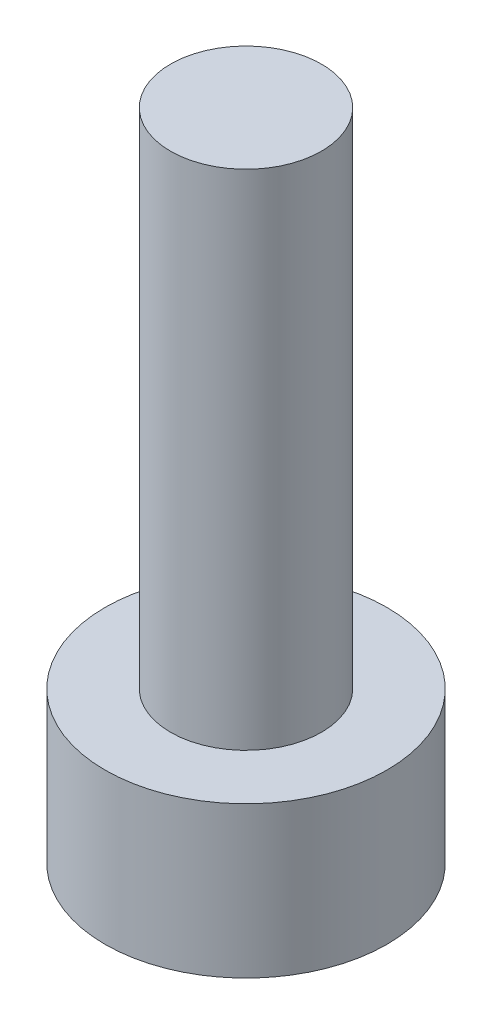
ISO-10303-21;
HEADER;
FILE_DESCRIPTION(('STEP AP214'),'2;1');
FILE_NAME('part.step','',(''),(''),'','','');
FILE_SCHEMA(('AUTOMOTIVE_DESIGN { 1 0 10303 214 1 1 1 1 }'));
ENDSEC;
DATA;
#1=APPLICATION_CONTEXT('core data for automotive mechanical design processes');
#2=APPLICATION_PROTOCOL_DEFINITION('international standard','automotive_design',2000,#1);
#3=PRODUCT_CONTEXT('',#1,'mechanical');
#4=PRODUCT('Part','Part','',(#3));
#5=PRODUCT_RELATED_PRODUCT_CATEGORY('part','',(#4));
#6=PRODUCT_DEFINITION_FORMATION('','',#4);
#7=PRODUCT_DEFINITION_CONTEXT('part definition',#1,'design');
#8=PRODUCT_DEFINITION('design','',#6,#7);
#9=PRODUCT_DEFINITION_SHAPE('','',#8);
#10=(LENGTH_UNIT() NAMED_UNIT(*) SI_UNIT(.MILLI.,.METRE.));
#11=(NAMED_UNIT(*) PLANE_ANGLE_UNIT() SI_UNIT($,.RADIAN.));
#12=(NAMED_UNIT(*) SI_UNIT($,.STERADIAN.) SOLID_ANGLE_UNIT());
#13=UNCERTAINTY_MEASURE_WITH_UNIT(LENGTH_MEASURE(1.E-05),#10,'distance_accuracy_value','');
#14=(GEOMETRIC_REPRESENTATION_CONTEXT(3) GLOBAL_UNCERTAINTY_ASSIGNED_CONTEXT((#13)) GLOBAL_UNIT_ASSIGNED_CONTEXT((#10,
#11,#12)) REPRESENTATION_CONTEXT('',''));
#15=CARTESIAN_POINT('',(0.,0.,0.));
#16=DIRECTION('',(0.,0.,1.));
#17=DIRECTION('',(1.,0.,0.));
#18=AXIS2_PLACEMENT_3D('',#15,#16,#17);
#19=CARTESIAN_POINT('',(0.,3.,0.));
#20=DIRECTION('',(0.,-1.,0.));
#21=DIRECTION('',(0.,0.,-1.));
#22=AXIS2_PLACEMENT_3D('',#19,#20,#21);
#23=CYLINDRICAL_SURFACE('',#22,2.8);
#24=CARTESIAN_POINT('',(0.,3.,0.));
#25=DIRECTION('',(0.,1.,0.));
#26=DIRECTION('',(0.,0.,1.));
#27=AXIS2_PLACEMENT_3D('',#24,#25,#26);
#28=CIRCLE('',#27,2.8);
#29=CARTESIAN_POINT('',(0.,3.,2.8));
#30=VERTEX_POINT('',#29);
#31=EDGE_CURVE('E51',#30,#30,#28,.T.);
#32=ORIENTED_EDGE('',*,*,#31,.F.);
#33=EDGE_LOOP('',(#32));
#34=FACE_BOUND('',#33,.T.);
#35=CARTESIAN_POINT('',(0.,0.,0.));
#36=DIRECTION('',(0.,1.,0.));
#37=DIRECTION('',(0.,0.,1.));
#38=AXIS2_PLACEMENT_3D('',#35,#36,#37);
#39=CIRCLE('',#38,2.8);
#40=CARTESIAN_POINT('',(0.,0.,2.8));
#41=VERTEX_POINT('',#40);
#42=EDGE_CURVE('E46',#41,#41,#39,.T.);
#43=ORIENTED_EDGE('',*,*,#42,.T.);
#44=EDGE_LOOP('',(#43));
#45=FACE_BOUND('',#44,.T.);
#46=ADVANCED_FACE('F43',(#34,#45),#23,.T.);
#47=CARTESIAN_POINT('',(0.,3.,0.));
#48=DIRECTION('',(0.,1.,0.));
#49=DIRECTION('',(0.,0.,1.));
#50=AXIS2_PLACEMENT_3D('',#47,#48,#49);
#51=PLANE('',#50);
#52=CARTESIAN_POINT('',(0.,3.,0.));
#53=DIRECTION('',(0.,1.,0.));
#54=DIRECTION('',(0.,0.,1.));
#55=AXIS2_PLACEMENT_3D('',#52,#53,#54);
#56=CIRCLE('',#55,1.5);
#57=CARTESIAN_POINT('',(0.,3.,1.5));
#58=VERTEX_POINT('',#57);
#59=EDGE_CURVE('E11',#58,#58,#56,.T.);
#60=ORIENTED_EDGE('',*,*,#59,.F.);
#61=EDGE_LOOP('',(#60));
#62=FACE_BOUND('',#61,.T.);
#63=ORIENTED_EDGE('',*,*,#31,.T.);
#64=EDGE_LOOP('',(#63));
#65=FACE_BOUND('',#64,.T.);
#66=ADVANCED_FACE('F161',(#62,#65),#51,.T.);
#67=CARTESIAN_POINT('',(0.,0.,0.));
#68=DIRECTION('',(0.,1.,0.));
#69=DIRECTION('',(0.,0.,1.));
#70=AXIS2_PLACEMENT_3D('',#67,#68,#69);
#71=PLANE('',#70);
#72=DIRECTION('',(0.195712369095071,0.,0.980661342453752));
#73=VECTOR('',#72,1.);
#74=CARTESIAN_POINT('',(1.08458344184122,0.,-0.952371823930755));
#75=LINE('',#74,#73);
#76=CARTESIAN_POINT('',(1.08458344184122,0.,-0.952371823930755));
#77=VERTEX_POINT('',#76);
#78=CARTESIAN_POINT('',(1.36706991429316,0.,0.463090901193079));
#79=VERTEX_POINT('',#78);
#80=EDGE_CURVE('E135',#77,#79,#75,.T.);
#81=ORIENTED_EDGE('',*,*,#80,.F.);
#82=DIRECTION('',(0.947133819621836,0.,0.320838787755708));
#83=VECTOR('',#82,1.);
#84=CARTESIAN_POINT('',(-0.282486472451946,0.,-1.41546272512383));
#85=LINE('',#84,#83);
#86=CARTESIAN_POINT('',(-0.282486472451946,0.,-1.41546272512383));
#87=VERTEX_POINT('',#86);
#88=EDGE_CURVE('E56',#87,#77,#85,.T.);
#89=ORIENTED_EDGE('',*,*,#88,.F.);
#90=DIRECTION('',(0.751421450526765,0.,-0.659822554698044));
#91=VECTOR('',#90,1.);
#92=CARTESIAN_POINT('',(-1.36706991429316,0.,-0.463090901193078));
#93=LINE('',#92,#91);
#94=CARTESIAN_POINT('',(-1.36706991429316,0.,-0.463090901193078));
#95=VERTEX_POINT('',#94);
#96=EDGE_CURVE('E145',#95,#87,#93,.T.);
#97=ORIENTED_EDGE('',*,*,#96,.F.);
#98=DIRECTION('',(-0.195712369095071,0.,-0.980661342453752));
#99=VECTOR('',#98,1.);
#100=CARTESIAN_POINT('',(-1.08458344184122,0.,0.952371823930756));
#101=LINE('',#100,#99);
#102=CARTESIAN_POINT('',(-1.08458344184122,0.,0.952371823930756));
#103=VERTEX_POINT('',#102);
#104=EDGE_CURVE('E140',#103,#95,#101,.T.);
#105=ORIENTED_EDGE('',*,*,#104,.F.);
#106=DIRECTION('',(-0.947133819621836,0.,-0.320838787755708));
#107=VECTOR('',#106,1.);
#108=CARTESIAN_POINT('',(0.282486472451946,0.,1.41546272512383));
#109=LINE('',#108,#107);
#110=CARTESIAN_POINT('',(0.282486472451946,0.,1.41546272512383));
#111=VERTEX_POINT('',#110);
#112=EDGE_CURVE('E110',#111,#103,#109,.T.);
#113=ORIENTED_EDGE('',*,*,#112,.F.);
#114=DIRECTION('',(-0.751421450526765,0.,0.659822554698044));
#115=VECTOR('',#114,1.);
#116=CARTESIAN_POINT('',(1.36706991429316,0.,0.463090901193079));
#117=LINE('',#116,#115);
#118=EDGE_CURVE('E136',#79,#111,#117,.T.);
#119=ORIENTED_EDGE('',*,*,#118,.F.);
#120=EDGE_LOOP('',(#81,#89,#97,#105,#113,#119));
#121=FACE_BOUND('',#120,.T.);
#122=ORIENTED_EDGE('',*,*,#42,.F.);
#123=EDGE_LOOP('',(#122));
#124=FACE_BOUND('',#123,.T.);
#125=ADVANCED_FACE('F160',(#121,#124),#71,.F.);
#126=CARTESIAN_POINT('',(0.,13.,0.));
#127=DIRECTION('',(0.,-1.,0.));
#128=DIRECTION('',(0.,0.,-1.));
#129=AXIS2_PLACEMENT_3D('',#126,#127,#128);
#130=CYLINDRICAL_SURFACE('',#129,1.5);
#131=CARTESIAN_POINT('',(0.,13.,0.));
#132=DIRECTION('',(0.,1.,0.));
#133=DIRECTION('',(0.,0.,1.));
#134=AXIS2_PLACEMENT_3D('',#131,#132,#133);
#135=CIRCLE('',#134,1.5);
#136=CARTESIAN_POINT('',(0.,13.,1.5));
#137=VERTEX_POINT('',#136);
#138=EDGE_CURVE('E147',#137,#137,#135,.T.);
#139=ORIENTED_EDGE('',*,*,#138,.F.);
#140=EDGE_LOOP('',(#139));
#141=FACE_BOUND('',#140,.T.);
#142=ORIENTED_EDGE('',*,*,#59,.T.);
#143=EDGE_LOOP('',(#142));
#144=FACE_BOUND('',#143,.T.);
#145=ADVANCED_FACE('F162',(#141,#144),#130,.T.);
#146=CARTESIAN_POINT('',(0.,13.,0.));
#147=DIRECTION('',(0.,1.,0.));
#148=DIRECTION('',(0.,0.,1.));
#149=AXIS2_PLACEMENT_3D('',#146,#147,#148);
#150=PLANE('',#149);
#151=ORIENTED_EDGE('',*,*,#138,.T.);
#152=EDGE_LOOP('',(#151));
#153=FACE_BOUND('',#152,.T.);
#154=ADVANCED_FACE('F167',(#153),#150,.T.);
#155=CARTESIAN_POINT('',(-0.282486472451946,1.5,-1.41546272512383));
#156=DIRECTION('',(0.320838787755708,0.,-0.947133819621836));
#157=DIRECTION('',(-0.947133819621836,0.,-0.320838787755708));
#158=AXIS2_PLACEMENT_3D('',#155,#156,#157);
#159=PLANE('',#158);
#160=ORIENTED_EDGE('',*,*,#88,.T.);
#161=DIRECTION('',(0.,-1.,0.));
#162=VECTOR('',#161,1.);
#163=CARTESIAN_POINT('',(1.08458344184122,1.5,-0.952371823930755));
#164=LINE('',#163,#162);
#165=CARTESIAN_POINT('',(1.08458344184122,1.5,-0.952371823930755));
#166=VERTEX_POINT('',#165);
#167=EDGE_CURVE('E88',#166,#77,#164,.T.);
#168=ORIENTED_EDGE('',*,*,#167,.F.);
#169=DIRECTION('',(0.947133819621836,0.,0.320838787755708));
#170=VECTOR('',#169,1.);
#171=CARTESIAN_POINT('',(-0.282486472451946,1.5,-1.41546272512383));
#172=LINE('',#171,#170);
#173=CARTESIAN_POINT('',(-0.282486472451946,1.5,-1.41546272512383));
#174=VERTEX_POINT('',#173);
#175=EDGE_CURVE('E144',#174,#166,#172,.T.);
#176=ORIENTED_EDGE('',*,*,#175,.F.);
#177=DIRECTION('',(0.,-1.,0.));
#178=VECTOR('',#177,1.);
#179=CARTESIAN_POINT('',(-0.282486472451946,1.5,-1.41546272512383));
#180=LINE('',#179,#178);
#181=EDGE_CURVE('E66',#174,#87,#180,.T.);
#182=ORIENTED_EDGE('',*,*,#181,.T.);
#183=EDGE_LOOP('',(#160,#168,#176,#182));
#184=FACE_BOUND('',#183,.T.);
#185=ADVANCED_FACE('F200',(#184),#159,.F.);
#186=CARTESIAN_POINT('',(-1.36706991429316,1.5,-0.463090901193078));
#187=DIRECTION('',(-0.659822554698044,0.,-0.751421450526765));
#188=DIRECTION('',(-0.751421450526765,0.,0.659822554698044));
#189=AXIS2_PLACEMENT_3D('',#186,#187,#188);
#190=PLANE('',#189);
#191=ORIENTED_EDGE('',*,*,#96,.T.);
#192=ORIENTED_EDGE('',*,*,#181,.F.);
#193=DIRECTION('',(0.751421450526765,0.,-0.659822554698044));
#194=VECTOR('',#193,1.);
#195=CARTESIAN_POINT('',(-1.36706991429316,1.5,-0.463090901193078));
#196=LINE('',#195,#194);
#197=CARTESIAN_POINT('',(-1.36706991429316,1.5,-0.463090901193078));
#198=VERTEX_POINT('',#197);
#199=EDGE_CURVE('E118',#198,#174,#196,.T.);
#200=ORIENTED_EDGE('',*,*,#199,.F.);
#201=DIRECTION('',(0.,-1.,0.));
#202=VECTOR('',#201,1.);
#203=CARTESIAN_POINT('',(-1.36706991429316,1.5,-0.463090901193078));
#204=LINE('',#203,#202);
#205=EDGE_CURVE('E111',#198,#95,#204,.T.);
#206=ORIENTED_EDGE('',*,*,#205,.T.);
#207=EDGE_LOOP('',(#191,#192,#200,#206));
#208=FACE_BOUND('',#207,.T.);
#209=ADVANCED_FACE('F208',(#208),#190,.F.);
#210=CARTESIAN_POINT('',(-1.08458344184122,1.5,0.952371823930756));
#211=DIRECTION('',(-0.980661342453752,0.,0.195712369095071));
#212=DIRECTION('',(0.195712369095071,0.,0.980661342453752));
#213=AXIS2_PLACEMENT_3D('',#210,#211,#212);
#214=PLANE('',#213);
#215=ORIENTED_EDGE('',*,*,#104,.T.);
#216=ORIENTED_EDGE('',*,*,#205,.F.);
#217=DIRECTION('',(-0.195712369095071,0.,-0.980661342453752));
#218=VECTOR('',#217,1.);
#219=CARTESIAN_POINT('',(-1.08458344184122,1.5,0.952371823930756));
#220=LINE('',#219,#218);
#221=CARTESIAN_POINT('',(-1.08458344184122,1.5,0.952371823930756));
#222=VERTEX_POINT('',#221);
#223=EDGE_CURVE('E114',#222,#198,#220,.T.);
#224=ORIENTED_EDGE('',*,*,#223,.F.);
#225=DIRECTION('',(0.,-1.,0.));
#226=VECTOR('',#225,1.);
#227=CARTESIAN_POINT('',(-1.08458344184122,1.5,0.952371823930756));
#228=LINE('',#227,#226);
#229=EDGE_CURVE('E99',#222,#103,#228,.T.);
#230=ORIENTED_EDGE('',*,*,#229,.T.);
#231=EDGE_LOOP('',(#215,#216,#224,#230));
#232=FACE_BOUND('',#231,.T.);
#233=ADVANCED_FACE('F116',(#232),#214,.F.);
#234=CARTESIAN_POINT('',(0.282486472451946,1.5,1.41546272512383));
#235=DIRECTION('',(-0.320838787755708,0.,0.947133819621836));
#236=DIRECTION('',(0.947133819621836,0.,0.320838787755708));
#237=AXIS2_PLACEMENT_3D('',#234,#235,#236);
#238=PLANE('',#237);
#239=ORIENTED_EDGE('',*,*,#112,.T.);
#240=ORIENTED_EDGE('',*,*,#229,.F.);
#241=DIRECTION('',(-0.947133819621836,0.,-0.320838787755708));
#242=VECTOR('',#241,1.);
#243=CARTESIAN_POINT('',(0.282486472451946,1.5,1.41546272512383));
#244=LINE('',#243,#242);
#245=CARTESIAN_POINT('',(0.282486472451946,1.5,1.41546272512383));
#246=VERTEX_POINT('',#245);
#247=EDGE_CURVE('E104',#246,#222,#244,.T.);
#248=ORIENTED_EDGE('',*,*,#247,.F.);
#249=DIRECTION('',(0.,-1.,0.));
#250=VECTOR('',#249,1.);
#251=CARTESIAN_POINT('',(0.282486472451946,1.5,1.41546272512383));
#252=LINE('',#251,#250);
#253=EDGE_CURVE('E115',#246,#111,#252,.T.);
#254=ORIENTED_EDGE('',*,*,#253,.T.);
#255=EDGE_LOOP('',(#239,#240,#248,#254));
#256=FACE_BOUND('',#255,.T.);
#257=ADVANCED_FACE('F105',(#256),#238,.F.);
#258=CARTESIAN_POINT('',(1.36706991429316,1.5,0.463090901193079));
#259=DIRECTION('',(0.659822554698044,0.,0.751421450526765));
#260=DIRECTION('',(0.751421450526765,0.,-0.659822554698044));
#261=AXIS2_PLACEMENT_3D('',#258,#259,#260);
#262=PLANE('',#261);
#263=ORIENTED_EDGE('',*,*,#118,.T.);
#264=ORIENTED_EDGE('',*,*,#253,.F.);
#265=DIRECTION('',(-0.751421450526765,0.,0.659822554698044));
#266=VECTOR('',#265,1.);
#267=CARTESIAN_POINT('',(1.36706991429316,1.5,0.463090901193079));
#268=LINE('',#267,#266);
#269=CARTESIAN_POINT('',(1.36706991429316,1.5,0.463090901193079));
#270=VERTEX_POINT('',#269);
#271=EDGE_CURVE('E123',#270,#246,#268,.T.);
#272=ORIENTED_EDGE('',*,*,#271,.F.);
#273=DIRECTION('',(0.,-1.,0.));
#274=VECTOR('',#273,1.);
#275=CARTESIAN_POINT('',(1.36706991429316,1.5,0.463090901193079));
#276=LINE('',#275,#274);
#277=EDGE_CURVE('E146',#270,#79,#276,.T.);
#278=ORIENTED_EDGE('',*,*,#277,.T.);
#279=EDGE_LOOP('',(#263,#264,#272,#278));
#280=FACE_BOUND('',#279,.T.);
#281=ADVANCED_FACE('F232',(#280),#262,.F.);
#282=CARTESIAN_POINT('',(1.08458344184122,1.5,-0.952371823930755));
#283=DIRECTION('',(0.980661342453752,0.,-0.195712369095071));
#284=DIRECTION('',(-0.195712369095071,0.,-0.980661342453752));
#285=AXIS2_PLACEMENT_3D('',#282,#283,#284);
#286=PLANE('',#285);
#287=ORIENTED_EDGE('',*,*,#80,.T.);
#288=ORIENTED_EDGE('',*,*,#277,.F.);
#289=DIRECTION('',(0.195712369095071,0.,0.980661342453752));
#290=VECTOR('',#289,1.);
#291=CARTESIAN_POINT('',(1.08458344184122,1.5,-0.952371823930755));
#292=LINE('',#291,#290);
#293=EDGE_CURVE('E130',#166,#270,#292,.T.);
#294=ORIENTED_EDGE('',*,*,#293,.F.);
#295=ORIENTED_EDGE('',*,*,#167,.T.);
#296=EDGE_LOOP('',(#287,#288,#294,#295));
#297=FACE_BOUND('',#296,.T.);
#298=ADVANCED_FACE('F242',(#297),#286,.F.);
#299=CARTESIAN_POINT('',(0.,1.5,0.));
#300=DIRECTION('',(0.,-1.,0.));
#301=DIRECTION('',(0.,0.,-1.));
#302=AXIS2_PLACEMENT_3D('',#299,#300,#301);
#303=PLANE('',#302);
#304=ORIENTED_EDGE('',*,*,#175,.T.);
#305=ORIENTED_EDGE('',*,*,#293,.T.);
#306=ORIENTED_EDGE('',*,*,#271,.T.);
#307=ORIENTED_EDGE('',*,*,#247,.T.);
#308=ORIENTED_EDGE('',*,*,#223,.T.);
#309=ORIENTED_EDGE('',*,*,#199,.T.);
#310=EDGE_LOOP('',(#304,#305,#306,#307,#308,#309));
#311=FACE_BOUND('',#310,.T.);
#312=ADVANCED_FACE('F125',(#311),#303,.T.);
#313=CLOSED_SHELL('',(#46,#66,#125,#145,#154,#185,#209,#233,#257,#281,#298,#312));
#314=MANIFOLD_SOLID_BREP('B2',#313);
#315=ADVANCED_BREP_SHAPE_REPRESENTATION('',(#18,#314),#14);
#316=SHAPE_DEFINITION_REPRESENTATION(#9,#315);
ENDSEC;
END-ISO-10303-21;
